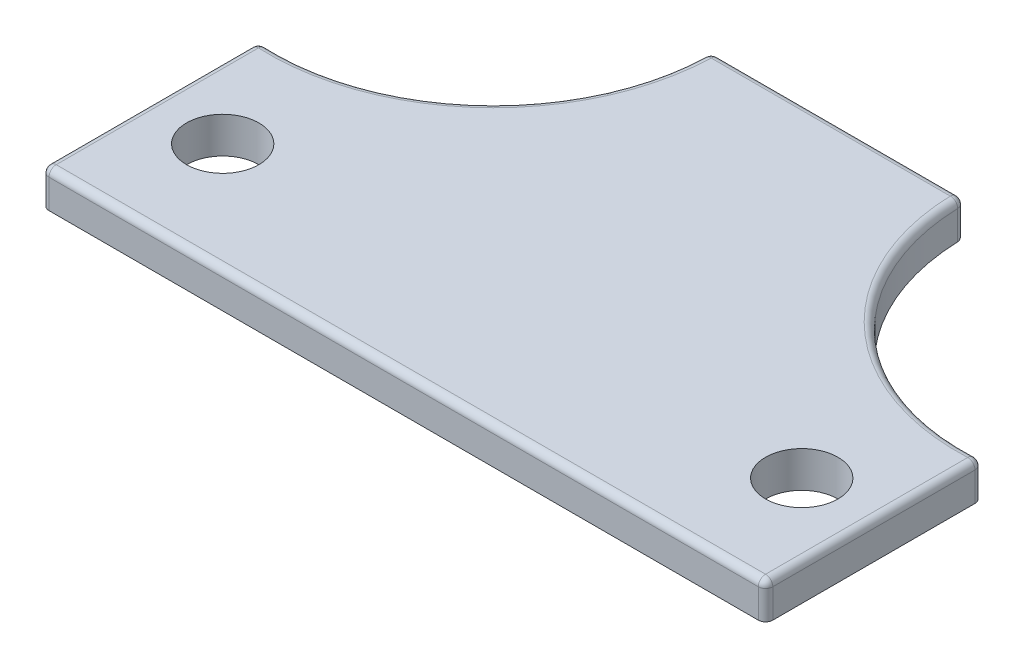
ISO-10303-21;
HEADER;
FILE_DESCRIPTION(('STEP AP214'),'2;1');
FILE_NAME('part.step','',(''),(''),'','','');
FILE_SCHEMA(('AUTOMOTIVE_DESIGN { 1 0 10303 214 1 1 1 1 }'));
ENDSEC;
DATA;
#1=APPLICATION_CONTEXT('core data for automotive mechanical design processes');
#2=APPLICATION_PROTOCOL_DEFINITION('international standard','automotive_design',2000,#1);
#3=PRODUCT_CONTEXT('',#1,'mechanical');
#4=PRODUCT('Part','Part','',(#3));
#5=PRODUCT_RELATED_PRODUCT_CATEGORY('part','',(#4));
#6=PRODUCT_DEFINITION_FORMATION('','',#4);
#7=PRODUCT_DEFINITION_CONTEXT('part definition',#1,'design');
#8=PRODUCT_DEFINITION('design','',#6,#7);
#9=PRODUCT_DEFINITION_SHAPE('','',#8);
#10=(LENGTH_UNIT() NAMED_UNIT(*) SI_UNIT(.MILLI.,.METRE.));
#11=(NAMED_UNIT(*) PLANE_ANGLE_UNIT() SI_UNIT($,.RADIAN.));
#12=(NAMED_UNIT(*) SI_UNIT($,.STERADIAN.) SOLID_ANGLE_UNIT());
#13=UNCERTAINTY_MEASURE_WITH_UNIT(LENGTH_MEASURE(1.E-05),#10,'distance_accuracy_value','');
#14=(GEOMETRIC_REPRESENTATION_CONTEXT(3) GLOBAL_UNCERTAINTY_ASSIGNED_CONTEXT((#13)) GLOBAL_UNIT_ASSIGNED_CONTEXT((#10,
#11,#12)) REPRESENTATION_CONTEXT('',''));
#15=CARTESIAN_POINT('',(0.,0.,0.));
#16=DIRECTION('',(0.,0.,1.));
#17=DIRECTION('',(1.,0.,0.));
#18=AXIS2_PLACEMENT_3D('',#15,#16,#17);
#19=CARTESIAN_POINT('',(-4.75961538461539,0.5,-6.));
#20=DIRECTION('',(0.,1.,0.));
#21=DIRECTION('',(0.,0.,1.));
#22=AXIS2_PLACEMENT_3D('',#19,#20,#21);
#23=PLANE('',#22);
#24=CARTESIAN_POINT('',(4.75961538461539,0.5,-6.));
#25=DIRECTION('',(0.,1.,0.));
#26=DIRECTION('',(0.,0.,1.));
#27=AXIS2_PLACEMENT_3D('',#24,#25,#26);
#28=CIRCLE('',#27,3.10961538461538);
#29=CARTESIAN_POINT('',(4.9,0.5,-2.89355508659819));
#30=VERTEX_POINT('',#29);
#31=CARTESIAN_POINT('',(1.65160833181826,0.5,-5.9));
#32=VERTEX_POINT('',#31);
#33=EDGE_CURVE('E389',#30,#32,#28,.F.);
#34=ORIENTED_EDGE('',*,*,#33,.T.);
#35=DIRECTION('',(-1.,0.,0.));
#36=VECTOR('',#35,1.);
#37=CARTESIAN_POINT('',(-1.75,0.5,-5.9));
#38=LINE('',#37,#36);
#39=CARTESIAN_POINT('',(-1.65160833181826,0.5,-5.9));
#40=VERTEX_POINT('',#39);
#41=EDGE_CURVE('E363',#32,#40,#38,.T.);
#42=ORIENTED_EDGE('',*,*,#41,.T.);
#43=CARTESIAN_POINT('',(-4.75961538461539,0.5,-6.));
#44=DIRECTION('',(0.,1.,0.));
#45=DIRECTION('',(0.,0.,1.));
#46=AXIS2_PLACEMENT_3D('',#43,#44,#45);
#47=CIRCLE('',#46,3.10961538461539);
#48=CARTESIAN_POINT('',(-4.9,0.5,-2.89355508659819));
#49=VERTEX_POINT('',#48);
#50=EDGE_CURVE('E191',#40,#49,#47,.F.);
#51=ORIENTED_EDGE('',*,*,#50,.T.);
#52=DIRECTION('',(0.,0.,1.));
#53=VECTOR('',#52,1.);
#54=CARTESIAN_POINT('',(-4.9,0.5,0.));
#55=LINE('',#54,#53);
#56=CARTESIAN_POINT('',(-4.9,0.5,-0.1));
#57=VERTEX_POINT('',#56);
#58=EDGE_CURVE('E394',#49,#57,#55,.T.);
#59=ORIENTED_EDGE('',*,*,#58,.T.);
#60=DIRECTION('',(1.,0.,0.));
#61=VECTOR('',#60,1.);
#62=CARTESIAN_POINT('',(5.,0.5,-0.1));
#63=LINE('',#62,#61);
#64=CARTESIAN_POINT('',(4.9,0.5,-0.1));
#65=VERTEX_POINT('',#64);
#66=EDGE_CURVE('E393',#57,#65,#63,.T.);
#67=ORIENTED_EDGE('',*,*,#66,.T.);
#68=DIRECTION('',(0.,0.,-1.));
#69=VECTOR('',#68,1.);
#70=CARTESIAN_POINT('',(4.9,0.5,-3.));
#71=LINE('',#70,#69);
#72=EDGE_CURVE('E391',#65,#30,#71,.T.);
#73=ORIENTED_EDGE('',*,*,#72,.T.);
#74=EDGE_LOOP('',(#34,#42,#51,#59,#67,#73));
#75=FACE_BOUND('',#74,.T.);
#76=CARTESIAN_POINT('',(-4.,0.5,-1.5));
#77=DIRECTION('',(0.,1.,0.));
#78=DIRECTION('',(0.,0.,1.));
#79=AXIS2_PLACEMENT_3D('',#76,#77,#78);
#80=CIRCLE('',#79,0.5);
#81=CARTESIAN_POINT('',(-4.,0.5,-0.999999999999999));
#82=VERTEX_POINT('',#81);
#83=EDGE_CURVE('E332',#82,#82,#80,.T.);
#84=ORIENTED_EDGE('',*,*,#83,.F.);
#85=EDGE_LOOP('',(#84));
#86=FACE_BOUND('',#85,.T.);
#87=CARTESIAN_POINT('',(4.,0.5,-1.5));
#88=DIRECTION('',(0.,1.,0.));
#89=DIRECTION('',(0.,0.,1.));
#90=AXIS2_PLACEMENT_3D('',#87,#88,#89);
#91=CIRCLE('',#90,0.5);
#92=CARTESIAN_POINT('',(4.,0.5,-1.));
#93=VERTEX_POINT('',#92);
#94=EDGE_CURVE('E324',#93,#93,#91,.T.);
#95=ORIENTED_EDGE('',*,*,#94,.F.);
#96=EDGE_LOOP('',(#95));
#97=FACE_BOUND('',#96,.T.);
#98=ADVANCED_FACE('F35',(#75,#86,#97),#23,.T.);
#99=CARTESIAN_POINT('',(-4.75961538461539,0.,-6.));
#100=DIRECTION('',(0.,1.,0.));
#101=DIRECTION('',(0.,0.,1.));
#102=AXIS2_PLACEMENT_3D('',#99,#100,#101);
#103=PLANE('',#102);
#104=CARTESIAN_POINT('',(-4.75961538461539,0.,-6.));
#105=DIRECTION('',(0.,-1.,0.));
#106=DIRECTION('',(0.,0.,1.));
#107=AXIS2_PLACEMENT_3D('',#104,#105,#106);
#108=CIRCLE('',#107,3.00961538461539);
#109=CARTESIAN_POINT('',(-1.75166180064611,0.,-5.9));
#110=VERTEX_POINT('',#109);
#111=CARTESIAN_POINT('',(-4.89548546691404,0.,-2.99345312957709));
#112=VERTEX_POINT('',#111);
#113=EDGE_CURVE('E169',#110,#112,#108,.T.);
#114=ORIENTED_EDGE('',*,*,#113,.F.);
#115=DIRECTION('',(-1.,0.,0.));
#116=VECTOR('',#115,1.);
#117=CARTESIAN_POINT('',(-4.75961538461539,0.,-5.9));
#118=LINE('',#117,#116);
#119=CARTESIAN_POINT('',(1.75166180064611,0.,-5.9));
#120=VERTEX_POINT('',#119);
#121=EDGE_CURVE('E252',#110,#120,#118,.F.);
#122=ORIENTED_EDGE('',*,*,#121,.T.);
#123=CARTESIAN_POINT('',(4.75961538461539,0.,-6.));
#124=DIRECTION('',(0.,-1.,0.));
#125=DIRECTION('',(0.,0.,-1.));
#126=AXIS2_PLACEMENT_3D('',#123,#124,#125);
#127=CIRCLE('',#126,3.00961538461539);
#128=CARTESIAN_POINT('',(4.89548546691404,0.,-2.99345312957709));
#129=VERTEX_POINT('',#128);
#130=EDGE_CURVE('E345',#129,#120,#127,.T.);
#131=ORIENTED_EDGE('',*,*,#130,.F.);
#132=CARTESIAN_POINT('',(4.9,0.,-2.89355508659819));
#133=DIRECTION('',(0.,1.,0.));
#134=DIRECTION('',(0.,0.,1.));
#135=AXIS2_PLACEMENT_3D('',#132,#133,#134);
#136=CIRCLE('',#135,0.1);
#137=CARTESIAN_POINT('',(5.,0.,-2.89355508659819));
#138=VERTEX_POINT('',#137);
#139=EDGE_CURVE('E250',#129,#138,#136,.F.);
#140=ORIENTED_EDGE('',*,*,#139,.T.);
#141=DIRECTION('',(0.,0.,-1.));
#142=VECTOR('',#141,1.);
#143=CARTESIAN_POINT('',(5.,0.,0.));
#144=LINE('',#143,#142);
#145=CARTESIAN_POINT('',(5.,0.,-0.1));
#146=VERTEX_POINT('',#145);
#147=EDGE_CURVE('E342',#146,#138,#144,.T.);
#148=ORIENTED_EDGE('',*,*,#147,.F.);
#149=CARTESIAN_POINT('',(4.9,0.,-0.1));
#150=DIRECTION('',(0.,1.,0.));
#151=DIRECTION('',(0.,0.,1.));
#152=AXIS2_PLACEMENT_3D('',#149,#150,#151);
#153=CIRCLE('',#152,0.1);
#154=CARTESIAN_POINT('',(4.9,0.,0.));
#155=VERTEX_POINT('',#154);
#156=EDGE_CURVE('E248',#146,#155,#153,.F.);
#157=ORIENTED_EDGE('',*,*,#156,.T.);
#158=DIRECTION('',(1.,0.,0.));
#159=VECTOR('',#158,1.);
#160=CARTESIAN_POINT('',(5.,0.,0.));
#161=LINE('',#160,#159);
#162=CARTESIAN_POINT('',(-4.9,0.,0.));
#163=VERTEX_POINT('',#162);
#164=EDGE_CURVE('E339',#163,#155,#161,.T.);
#165=ORIENTED_EDGE('',*,*,#164,.F.);
#166=CARTESIAN_POINT('',(-4.9,0.,-0.1));
#167=DIRECTION('',(0.,1.,0.));
#168=DIRECTION('',(0.,0.,1.));
#169=AXIS2_PLACEMENT_3D('',#166,#167,#168);
#170=CIRCLE('',#169,0.1);
#171=CARTESIAN_POINT('',(-5.,0.,-0.1));
#172=VERTEX_POINT('',#171);
#173=EDGE_CURVE('E246',#163,#172,#170,.F.);
#174=ORIENTED_EDGE('',*,*,#173,.T.);
#175=DIRECTION('',(0.,0.,1.));
#176=VECTOR('',#175,1.);
#177=CARTESIAN_POINT('',(-5.,0.,0.));
#178=LINE('',#177,#176);
#179=CARTESIAN_POINT('',(-5.,0.,-2.89355508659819));
#180=VERTEX_POINT('',#179);
#181=EDGE_CURVE('E335',#180,#172,#178,.T.);
#182=ORIENTED_EDGE('',*,*,#181,.F.);
#183=CARTESIAN_POINT('',(-4.9,0.,-2.89355508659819));
#184=DIRECTION('',(0.,1.,0.));
#185=DIRECTION('',(0.,0.,1.));
#186=AXIS2_PLACEMENT_3D('',#183,#184,#185);
#187=CIRCLE('',#186,0.1);
#188=EDGE_CURVE('E242',#180,#112,#187,.F.);
#189=ORIENTED_EDGE('',*,*,#188,.T.);
#190=EDGE_LOOP('',(#114,#122,#131,#140,#148,#157,#165,#174,#182,#189));
#191=FACE_BOUND('',#190,.T.);
#192=CARTESIAN_POINT('',(-4.,0.,-1.5));
#193=DIRECTION('',(0.,1.,0.));
#194=DIRECTION('',(0.,0.,1.));
#195=AXIS2_PLACEMENT_3D('',#192,#193,#194);
#196=CIRCLE('',#195,0.5);
#197=CARTESIAN_POINT('',(-4.,0.,-0.999999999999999));
#198=VERTEX_POINT('',#197);
#199=EDGE_CURVE('E329',#198,#198,#196,.T.);
#200=ORIENTED_EDGE('',*,*,#199,.T.);
#201=EDGE_LOOP('',(#200));
#202=FACE_BOUND('',#201,.T.);
#203=CARTESIAN_POINT('',(4.,0.,-1.5));
#204=DIRECTION('',(0.,1.,0.));
#205=DIRECTION('',(0.,0.,1.));
#206=AXIS2_PLACEMENT_3D('',#203,#204,#205);
#207=CIRCLE('',#206,0.5);
#208=CARTESIAN_POINT('',(4.,0.,-1.));
#209=VERTEX_POINT('',#208);
#210=EDGE_CURVE('E320',#209,#209,#207,.T.);
#211=ORIENTED_EDGE('',*,*,#210,.T.);
#212=EDGE_LOOP('',(#211));
#213=FACE_BOUND('',#212,.T.);
#214=ADVANCED_FACE('F213',(#191,#202,#213),#103,.F.);
#215=CARTESIAN_POINT('',(-5.,0.5,0.));
#216=DIRECTION('',(1.,0.,0.));
#217=DIRECTION('',(0.,0.,-1.));
#218=AXIS2_PLACEMENT_3D('',#215,#216,#217);
#219=PLANE('',#218);
#220=ORIENTED_EDGE('',*,*,#181,.T.);
#221=DIRECTION('',(0.,-1.,0.));
#222=VECTOR('',#221,1.);
#223=CARTESIAN_POINT('',(-5.,0.5,-0.1));
#224=LINE('',#223,#222);
#225=CARTESIAN_POINT('',(-5.,0.4,-0.1));
#226=VERTEX_POINT('',#225);
#227=EDGE_CURVE('E11',#172,#226,#224,.F.);
#228=ORIENTED_EDGE('',*,*,#227,.T.);
#229=DIRECTION('',(0.,0.,1.));
#230=VECTOR('',#229,1.);
#231=CARTESIAN_POINT('',(-5.,0.4,-3.));
#232=LINE('',#231,#230);
#233=CARTESIAN_POINT('',(-5.,0.4,-2.89355508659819));
#234=VERTEX_POINT('',#233);
#235=EDGE_CURVE('E51',#226,#234,#232,.F.);
#236=ORIENTED_EDGE('',*,*,#235,.T.);
#237=DIRECTION('',(0.,-1.,0.));
#238=VECTOR('',#237,1.);
#239=CARTESIAN_POINT('',(-5.,0.5,-2.89355508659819));
#240=LINE('',#239,#238);
#241=EDGE_CURVE('E44',#234,#180,#240,.T.);
#242=ORIENTED_EDGE('',*,*,#241,.T.);
#243=EDGE_LOOP('',(#220,#228,#236,#242));
#244=FACE_BOUND('',#243,.T.);
#245=ADVANCED_FACE('F210',(#244),#219,.F.);
#246=CARTESIAN_POINT('',(5.,0.5,0.));
#247=DIRECTION('',(0.,0.,-1.));
#248=DIRECTION('',(-1.,0.,0.));
#249=AXIS2_PLACEMENT_3D('',#246,#247,#248);
#250=PLANE('',#249);
#251=ORIENTED_EDGE('',*,*,#164,.T.);
#252=DIRECTION('',(0.,-1.,0.));
#253=VECTOR('',#252,1.);
#254=CARTESIAN_POINT('',(4.9,0.5,0.));
#255=LINE('',#254,#253);
#256=CARTESIAN_POINT('',(4.9,0.4,0.));
#257=VERTEX_POINT('',#256);
#258=EDGE_CURVE('E264',#155,#257,#255,.F.);
#259=ORIENTED_EDGE('',*,*,#258,.T.);
#260=DIRECTION('',(1.,0.,0.));
#261=VECTOR('',#260,1.);
#262=CARTESIAN_POINT('',(-5.,0.4,0.));
#263=LINE('',#262,#261);
#264=CARTESIAN_POINT('',(-4.9,0.4,0.));
#265=VERTEX_POINT('',#264);
#266=EDGE_CURVE('E260',#257,#265,#263,.F.);
#267=ORIENTED_EDGE('',*,*,#266,.T.);
#268=DIRECTION('',(0.,-1.,0.));
#269=VECTOR('',#268,1.);
#270=CARTESIAN_POINT('',(-4.9,0.5,0.));
#271=LINE('',#270,#269);
#272=EDGE_CURVE('E262',#265,#163,#271,.T.);
#273=ORIENTED_EDGE('',*,*,#272,.T.);
#274=EDGE_LOOP('',(#251,#259,#267,#273));
#275=FACE_BOUND('',#274,.T.);
#276=ADVANCED_FACE('F206',(#275),#250,.F.);
#277=CARTESIAN_POINT('',(5.,0.5,0.));
#278=DIRECTION('',(-1.,0.,0.));
#279=DIRECTION('',(0.,0.,1.));
#280=AXIS2_PLACEMENT_3D('',#277,#278,#279);
#281=PLANE('',#280);
#282=ORIENTED_EDGE('',*,*,#147,.T.);
#283=DIRECTION('',(0.,-1.,0.));
#284=VECTOR('',#283,1.);
#285=CARTESIAN_POINT('',(5.,0.5,-2.89355508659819));
#286=LINE('',#285,#284);
#287=CARTESIAN_POINT('',(5.,0.4,-2.89355508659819));
#288=VERTEX_POINT('',#287);
#289=EDGE_CURVE('E258',#138,#288,#286,.F.);
#290=ORIENTED_EDGE('',*,*,#289,.T.);
#291=DIRECTION('',(0.,0.,-1.));
#292=VECTOR('',#291,1.);
#293=CARTESIAN_POINT('',(5.,0.4,0.));
#294=LINE('',#293,#292);
#295=CARTESIAN_POINT('',(5.,0.4,-0.1));
#296=VERTEX_POINT('',#295);
#297=EDGE_CURVE('E254',#288,#296,#294,.F.);
#298=ORIENTED_EDGE('',*,*,#297,.T.);
#299=DIRECTION('',(0.,-1.,0.));
#300=VECTOR('',#299,1.);
#301=CARTESIAN_POINT('',(5.,0.5,-0.1));
#302=LINE('',#301,#300);
#303=EDGE_CURVE('E256',#296,#146,#302,.T.);
#304=ORIENTED_EDGE('',*,*,#303,.T.);
#305=EDGE_LOOP('',(#282,#290,#298,#304));
#306=FACE_BOUND('',#305,.T.);
#307=ADVANCED_FACE('F201',(#306),#281,.F.);
#308=CARTESIAN_POINT('',(4.75961538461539,0.5,-6.));
#309=DIRECTION('',(0.,-1.,0.));
#310=DIRECTION('',(0.,0.,-1.));
#311=AXIS2_PLACEMENT_3D('',#308,#309,#310);
#312=CYLINDRICAL_SURFACE('',#311,3.00961538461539);
#313=ORIENTED_EDGE('',*,*,#130,.T.);
#314=CARTESIAN_POINT('',(1.75166180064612,0.,-5.9));
#315=CARTESIAN_POINT('',(1.75164397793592,4.0431391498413E-10,-5.90053610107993));
#316=CARTESIAN_POINT('',(1.75162630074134,4.31071029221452E-06,-5.90107213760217));
#317=CARTESIAN_POINT('',(1.75159123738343,2.15511255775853E-05,-5.90214408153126));
#318=CARTESIAN_POINT('',(1.7515738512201,3.44812348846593E-05,-5.9026799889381));
#319=CARTESIAN_POINT('',(1.7515566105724,5.17212458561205E-05,-5.90321583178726));
#320=B_SPLINE_CURVE_WITH_KNOTS('',3,(#314,#315,#316,#317,#318,#319),.UNSPECIFIED.,.F.,.F.,(4,2,
4),(0.,0.00160903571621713,0.00321807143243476),.UNSPECIFIED.);
#321=CARTESIAN_POINT('',(1.7515566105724,5.17212458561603E-05,-5.90321583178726));
#322=VERTEX_POINT('',#321);
#323=EDGE_CURVE('E184',#120,#322,#320,.T.);
#324=ORIENTED_EDGE('',*,*,#323,.T.);
#325=DIRECTION('',(0.,-1.,0.));
#326=VECTOR('',#325,1.);
#327=CARTESIAN_POINT('',(1.7515566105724,0.5,-5.90321583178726));
#328=LINE('',#327,#326);
#329=CARTESIAN_POINT('',(1.7515566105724,0.4,-5.90321583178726));
#330=VERTEX_POINT('',#329);
#331=EDGE_CURVE('E155',#322,#330,#328,.F.);
#332=ORIENTED_EDGE('',*,*,#331,.T.);
#333=CARTESIAN_POINT('',(4.75961538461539,0.4,-6.));
#334=DIRECTION('',(0.,1.,0.));
#335=DIRECTION('',(0.,0.,1.));
#336=AXIS2_PLACEMENT_3D('',#333,#334,#335);
#337=CIRCLE('',#336,3.00961538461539);
#338=CARTESIAN_POINT('',(4.89548546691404,0.4,-2.99345312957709));
#339=VERTEX_POINT('',#338);
#340=EDGE_CURVE('E175',#330,#339,#337,.T.);
#341=ORIENTED_EDGE('',*,*,#340,.T.);
#342=DIRECTION('',(0.,-1.,0.));
#343=VECTOR('',#342,1.);
#344=CARTESIAN_POINT('',(4.89548546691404,0.5,-2.99345312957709));
#345=LINE('',#344,#343);
#346=EDGE_CURVE('E177',#339,#129,#345,.T.);
#347=ORIENTED_EDGE('',*,*,#346,.T.);
#348=EDGE_LOOP('',(#313,#324,#332,#341,#347));
#349=FACE_BOUND('',#348,.T.);
#350=ADVANCED_FACE('F196',(#349),#312,.F.);
#351=CARTESIAN_POINT('',(-1.75,0.5,-6.));
#352=DIRECTION('',(0.,0.,1.));
#353=DIRECTION('',(1.,0.,0.));
#354=AXIS2_PLACEMENT_3D('',#351,#352,#353);
#355=PLANE('',#354);
#356=DIRECTION('',(-1.,0.,0.));
#357=VECTOR('',#356,1.);
#358=CARTESIAN_POINT('',(1.75,0.4,-6.));
#359=LINE('',#358,#357);
#360=CARTESIAN_POINT('',(-1.65160833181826,0.4,-6.));
#361=VERTEX_POINT('',#360);
#362=CARTESIAN_POINT('',(1.65160833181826,0.4,-6.));
#363=VERTEX_POINT('',#362);
#364=EDGE_CURVE('E173',#361,#363,#359,.F.);
#365=ORIENTED_EDGE('',*,*,#364,.T.);
#366=DIRECTION('',(0.,-1.,0.));
#367=VECTOR('',#366,1.);
#368=CARTESIAN_POINT('',(1.65160833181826,0.5,-6.));
#369=LINE('',#368,#367);
#370=CARTESIAN_POINT('',(1.65160833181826,0.1,-6.));
#371=VERTEX_POINT('',#370);
#372=EDGE_CURVE('E153',#363,#371,#369,.T.);
#373=ORIENTED_EDGE('',*,*,#372,.T.);
#374=DIRECTION('',(-1.,0.,0.));
#375=VECTOR('',#374,1.);
#376=CARTESIAN_POINT('',(-1.75,0.1,-6.));
#377=LINE('',#376,#375);
#378=CARTESIAN_POINT('',(-1.65160833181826,0.1,-6.));
#379=VERTEX_POINT('',#378);
#380=EDGE_CURVE('E161',#371,#379,#377,.T.);
#381=ORIENTED_EDGE('',*,*,#380,.T.);
#382=DIRECTION('',(0.,-1.,0.));
#383=VECTOR('',#382,1.);
#384=CARTESIAN_POINT('',(-1.65160833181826,0.5,-6.));
#385=LINE('',#384,#383);
#386=EDGE_CURVE('E168',#379,#361,#385,.F.);
#387=ORIENTED_EDGE('',*,*,#386,.T.);
#388=EDGE_LOOP('',(#365,#373,#381,#387));
#389=FACE_BOUND('',#388,.T.);
#390=ADVANCED_FACE('F171',(#389),#355,.F.);
#391=CARTESIAN_POINT('',(-4.75961538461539,0.5,-6.));
#392=DIRECTION('',(0.,-1.,0.));
#393=DIRECTION('',(0.,0.,-1.));
#394=AXIS2_PLACEMENT_3D('',#391,#392,#393);
#395=CYLINDRICAL_SURFACE('',#394,3.00961538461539);
#396=DIRECTION('',(0.,-1.,0.));
#397=VECTOR('',#396,1.);
#398=CARTESIAN_POINT('',(-1.7515566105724,0.5,-5.90321583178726));
#399=LINE('',#398,#397);
#400=CARTESIAN_POINT('',(-1.7515566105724,0.4,-5.90321583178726));
#401=VERTEX_POINT('',#400);
#402=CARTESIAN_POINT('',(-1.7515566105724,5.17212458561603E-05,-5.90321583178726));
#403=VERTEX_POINT('',#402);
#404=EDGE_CURVE('E243',#401,#403,#399,.T.);
#405=ORIENTED_EDGE('',*,*,#404,.T.);
#406=CARTESIAN_POINT('',(-1.7515566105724,5.17212458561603E-05,-5.90321583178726));
#407=CARTESIAN_POINT('',(-1.7515738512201,3.44812348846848E-05,-5.9026799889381));
#408=CARTESIAN_POINT('',(-1.75159123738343,2.15511255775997E-05,-5.90214408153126));
#409=CARTESIAN_POINT('',(-1.75162630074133,4.31071029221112E-06,-5.90107213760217));
#410=CARTESIAN_POINT('',(-1.75164397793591,4.04313907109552E-10,-5.90053610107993));
#411=CARTESIAN_POINT('',(-1.75166180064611,0.,-5.9));
#412=B_SPLINE_CURVE_WITH_KNOTS('',3,(#406,#407,#408,#409,#410,#411),.UNSPECIFIED.,.F.,.F.,(4,2,
4),(0.,0.00160903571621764,0.00321807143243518),.UNSPECIFIED.);
#413=EDGE_CURVE('E236',#403,#110,#412,.T.);
#414=ORIENTED_EDGE('',*,*,#413,.T.);
#415=ORIENTED_EDGE('',*,*,#113,.T.);
#416=DIRECTION('',(0.,-1.,0.));
#417=VECTOR('',#416,1.);
#418=CARTESIAN_POINT('',(-4.89548546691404,0.5,-2.99345312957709));
#419=LINE('',#418,#417);
#420=CARTESIAN_POINT('',(-4.89548546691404,0.4,-2.99345312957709));
#421=VERTEX_POINT('',#420);
#422=EDGE_CURVE('E380',#112,#421,#419,.F.);
#423=ORIENTED_EDGE('',*,*,#422,.T.);
#424=CARTESIAN_POINT('',(-4.75961538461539,0.4,-6.));
#425=DIRECTION('',(0.,1.,0.));
#426=DIRECTION('',(0.,0.,1.));
#427=AXIS2_PLACEMENT_3D('',#424,#425,#426);
#428=CIRCLE('',#427,3.00961538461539);
#429=EDGE_CURVE('E385',#421,#401,#428,.T.);
#430=ORIENTED_EDGE('',*,*,#429,.T.);
#431=EDGE_LOOP('',(#405,#414,#415,#423,#430));
#432=FACE_BOUND('',#431,.T.);
#433=ADVANCED_FACE('F231',(#432),#395,.F.);
#434=CARTESIAN_POINT('',(-4.,0.5,-1.5));
#435=DIRECTION('',(0.,-1.,0.));
#436=DIRECTION('',(0.,0.,-1.));
#437=AXIS2_PLACEMENT_3D('',#434,#435,#436);
#438=CYLINDRICAL_SURFACE('',#437,0.5);
#439=ORIENTED_EDGE('',*,*,#83,.T.);
#440=EDGE_LOOP('',(#439));
#441=FACE_BOUND('',#440,.T.);
#442=ORIENTED_EDGE('',*,*,#199,.F.);
#443=EDGE_LOOP('',(#442));
#444=FACE_BOUND('',#443,.T.);
#445=ADVANCED_FACE('F229',(#441,#444),#438,.F.);
#446=CARTESIAN_POINT('',(4.,0.5,-1.5));
#447=DIRECTION('',(0.,-1.,0.));
#448=DIRECTION('',(0.,0.,-1.));
#449=AXIS2_PLACEMENT_3D('',#446,#447,#448);
#450=CYLINDRICAL_SURFACE('',#449,0.5);
#451=ORIENTED_EDGE('',*,*,#94,.T.);
#452=EDGE_LOOP('',(#451));
#453=FACE_BOUND('',#452,.T.);
#454=ORIENTED_EDGE('',*,*,#210,.F.);
#455=EDGE_LOOP('',(#454));
#456=FACE_BOUND('',#455,.T.);
#457=ADVANCED_FACE('F443',(#453,#456),#450,.F.);
#458=CARTESIAN_POINT('',(-4.9,0.5,-0.1));
#459=DIRECTION('',(0.,-1.,0.));
#460=DIRECTION('',(0.,0.,-1.));
#461=AXIS2_PLACEMENT_3D('',#458,#459,#460);
#462=CYLINDRICAL_SURFACE('',#461,0.1);
#463=CARTESIAN_POINT('',(-4.9,0.4,-0.1));
#464=DIRECTION('',(0.,1.,0.));
#465=DIRECTION('',(0.,0.,1.));
#466=AXIS2_PLACEMENT_3D('',#463,#464,#465);
#467=CIRCLE('',#466,0.1);
#468=EDGE_CURVE('E39',#226,#265,#467,.T.);
#469=ORIENTED_EDGE('',*,*,#468,.F.);
#470=ORIENTED_EDGE('',*,*,#227,.F.);
#471=ORIENTED_EDGE('',*,*,#173,.F.);
#472=ORIENTED_EDGE('',*,*,#272,.F.);
#473=EDGE_LOOP('',(#469,#470,#471,#472));
#474=FACE_BOUND('',#473,.T.);
#475=ADVANCED_FACE('F37',(#474),#462,.T.);
#476=CARTESIAN_POINT('',(-4.9,0.4,-0.1));
#477=DIRECTION('',(0.,0.,1.));
#478=DIRECTION('',(1.,0.,0.));
#479=AXIS2_PLACEMENT_3D('',#476,#477,#478);
#480=SPHERICAL_SURFACE('',#479,0.1);
#481=CARTESIAN_POINT('',(-4.9,0.4,-0.1));
#482=DIRECTION('',(0.,0.,1.));
#483=DIRECTION('',(1.,0.,0.));
#484=AXIS2_PLACEMENT_3D('',#481,#482,#483);
#485=CIRCLE('',#484,0.1);
#486=EDGE_CURVE('E311',#226,#57,#485,.F.);
#487=ORIENTED_EDGE('',*,*,#486,.F.);
#488=ORIENTED_EDGE('',*,*,#468,.T.);
#489=CARTESIAN_POINT('',(-4.9,0.4,-0.1));
#490=DIRECTION('',(-1.,0.,0.));
#491=DIRECTION('',(0.,-1.,0.));
#492=AXIS2_PLACEMENT_3D('',#489,#490,#491);
#493=CIRCLE('',#492,0.1);
#494=EDGE_CURVE('E313',#57,#265,#493,.F.);
#495=ORIENTED_EDGE('',*,*,#494,.F.);
#496=EDGE_LOOP('',(#487,#488,#495));
#497=FACE_BOUND('',#496,.T.);
#498=ADVANCED_FACE('F437',(#497),#480,.T.);
#499=CARTESIAN_POINT('',(4.9,0.5,-0.1));
#500=DIRECTION('',(0.,-1.,0.));
#501=DIRECTION('',(0.,0.,-1.));
#502=AXIS2_PLACEMENT_3D('',#499,#500,#501);
#503=CYLINDRICAL_SURFACE('',#502,0.1);
#504=ORIENTED_EDGE('',*,*,#156,.F.);
#505=ORIENTED_EDGE('',*,*,#303,.F.);
#506=CARTESIAN_POINT('',(4.9,0.4,-0.1));
#507=DIRECTION('',(0.,1.,0.));
#508=DIRECTION('',(0.,0.,1.));
#509=AXIS2_PLACEMENT_3D('',#506,#507,#508);
#510=CIRCLE('',#509,0.1);
#511=EDGE_CURVE('E308',#257,#296,#510,.T.);
#512=ORIENTED_EDGE('',*,*,#511,.F.);
#513=ORIENTED_EDGE('',*,*,#258,.F.);
#514=EDGE_LOOP('',(#504,#505,#512,#513));
#515=FACE_BOUND('',#514,.T.);
#516=ADVANCED_FACE('F435',(#515),#503,.T.);
#517=CARTESIAN_POINT('',(-4.75961538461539,0.4,-0.1));
#518=DIRECTION('',(-1.,0.,0.));
#519=DIRECTION('',(0.,0.,1.));
#520=AXIS2_PLACEMENT_3D('',#517,#518,#519);
#521=CYLINDRICAL_SURFACE('',#520,0.1);
#522=ORIENTED_EDGE('',*,*,#494,.T.);
#523=ORIENTED_EDGE('',*,*,#266,.F.);
#524=CARTESIAN_POINT('',(4.9,0.4,-0.1));
#525=DIRECTION('',(1.,0.,0.));
#526=DIRECTION('',(0.,0.,-1.));
#527=AXIS2_PLACEMENT_3D('',#524,#525,#526);
#528=CIRCLE('',#527,0.1);
#529=EDGE_CURVE('E305',#65,#257,#528,.T.);
#530=ORIENTED_EDGE('',*,*,#529,.F.);
#531=ORIENTED_EDGE('',*,*,#66,.F.);
#532=EDGE_LOOP('',(#522,#523,#530,#531));
#533=FACE_BOUND('',#532,.T.);
#534=ADVANCED_FACE('F432',(#533),#521,.T.);
#535=CARTESIAN_POINT('',(-4.9,0.4,-6.));
#536=DIRECTION('',(0.,0.,-1.));
#537=DIRECTION('',(-1.,0.,0.));
#538=AXIS2_PLACEMENT_3D('',#535,#536,#537);
#539=CYLINDRICAL_SURFACE('',#538,0.1);
#540=ORIENTED_EDGE('',*,*,#486,.T.);
#541=ORIENTED_EDGE('',*,*,#58,.F.);
#542=CARTESIAN_POINT('',(-4.9,0.4,-2.89355508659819));
#543=DIRECTION('',(0.,0.,-1.));
#544=DIRECTION('',(0.,1.,0.));
#545=AXIS2_PLACEMENT_3D('',#542,#543,#544);
#546=CIRCLE('',#545,0.1);
#547=EDGE_CURVE('E302',#234,#49,#546,.T.);
#548=ORIENTED_EDGE('',*,*,#547,.F.);
#549=ORIENTED_EDGE('',*,*,#235,.F.);
#550=EDGE_LOOP('',(#540,#541,#548,#549));
#551=FACE_BOUND('',#550,.T.);
#552=ADVANCED_FACE('F399',(#551),#539,.T.);
#553=CARTESIAN_POINT('',(-4.9,0.5,-2.89355508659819));
#554=DIRECTION('',(0.,-1.,0.));
#555=DIRECTION('',(0.,0.,-1.));
#556=AXIS2_PLACEMENT_3D('',#553,#554,#555);
#557=CYLINDRICAL_SURFACE('',#556,0.1);
#558=ORIENTED_EDGE('',*,*,#188,.F.);
#559=ORIENTED_EDGE('',*,*,#241,.F.);
#560=CARTESIAN_POINT('',(-4.9,0.4,-2.89355508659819));
#561=DIRECTION('',(0.,1.,0.));
#562=DIRECTION('',(0.,0.,1.));
#563=AXIS2_PLACEMENT_3D('',#560,#561,#562);
#564=CIRCLE('',#563,0.1);
#565=EDGE_CURVE('E299',#421,#234,#564,.T.);
#566=ORIENTED_EDGE('',*,*,#565,.F.);
#567=ORIENTED_EDGE('',*,*,#422,.F.);
#568=EDGE_LOOP('',(#558,#559,#566,#567));
#569=FACE_BOUND('',#568,.T.);
#570=ADVANCED_FACE('F383',(#569),#557,.T.);
#571=CARTESIAN_POINT('',(4.9,0.4,-0.1));
#572=DIRECTION('',(0.,0.,1.));
#573=DIRECTION('',(1.,0.,0.));
#574=AXIS2_PLACEMENT_3D('',#571,#572,#573);
#575=SPHERICAL_SURFACE('',#574,0.1);
#576=ORIENTED_EDGE('',*,*,#529,.T.);
#577=ORIENTED_EDGE('',*,*,#511,.T.);
#578=CARTESIAN_POINT('',(4.9,0.4,-0.1));
#579=DIRECTION('',(0.,0.,1.));
#580=DIRECTION('',(0.,-1.,0.));
#581=AXIS2_PLACEMENT_3D('',#578,#579,#580);
#582=CIRCLE('',#581,0.1);
#583=EDGE_CURVE('E296',#65,#296,#582,.F.);
#584=ORIENTED_EDGE('',*,*,#583,.F.);
#585=EDGE_LOOP('',(#576,#577,#584));
#586=FACE_BOUND('',#585,.T.);
#587=ADVANCED_FACE('F424',(#586),#575,.T.);
#588=CARTESIAN_POINT('',(-4.9,0.4,-2.89355508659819));
#589=DIRECTION('',(0.,0.,1.));
#590=DIRECTION('',(1.,0.,0.));
#591=AXIS2_PLACEMENT_3D('',#588,#589,#590);
#592=SPHERICAL_SURFACE('',#591,0.1);
#593=ORIENTED_EDGE('',*,*,#565,.T.);
#594=ORIENTED_EDGE('',*,*,#547,.T.);
#595=CARTESIAN_POINT('',(-4.9,0.4,-2.89355508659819));
#596=DIRECTION('',(-0.998980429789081,0.,-0.0451453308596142));
#597=DIRECTION('',(-0.0451453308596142,0.,0.998980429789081));
#598=AXIS2_PLACEMENT_3D('',#595,#596,#597);
#599=CIRCLE('',#598,0.1);
#600=EDGE_CURVE('E293',#421,#49,#599,.F.);
#601=ORIENTED_EDGE('',*,*,#600,.F.);
#602=EDGE_LOOP('',(#593,#594,#601));
#603=FACE_BOUND('',#602,.T.);
#604=ADVANCED_FACE('F401',(#603),#592,.T.);
#605=CARTESIAN_POINT('',(4.9,0.5,-2.89355508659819));
#606=DIRECTION('',(0.,-1.,0.));
#607=DIRECTION('',(0.,0.,-1.));
#608=AXIS2_PLACEMENT_3D('',#605,#606,#607);
#609=CYLINDRICAL_SURFACE('',#608,0.1);
#610=ORIENTED_EDGE('',*,*,#139,.F.);
#611=ORIENTED_EDGE('',*,*,#346,.F.);
#612=CARTESIAN_POINT('',(4.9,0.4,-2.89355508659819));
#613=DIRECTION('',(0.,1.,0.));
#614=DIRECTION('',(0.,0.,1.));
#615=AXIS2_PLACEMENT_3D('',#612,#613,#614);
#616=CIRCLE('',#615,0.1);
#617=EDGE_CURVE('E290',#288,#339,#616,.T.);
#618=ORIENTED_EDGE('',*,*,#617,.F.);
#619=ORIENTED_EDGE('',*,*,#289,.F.);
#620=EDGE_LOOP('',(#610,#611,#618,#619));
#621=FACE_BOUND('',#620,.T.);
#622=ADVANCED_FACE('F414',(#621),#609,.T.);
#623=CARTESIAN_POINT('',(4.9,0.4,-5.99999999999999));
#624=DIRECTION('',(0.,0.,1.));
#625=DIRECTION('',(1.,0.,0.));
#626=AXIS2_PLACEMENT_3D('',#623,#624,#625);
#627=CYLINDRICAL_SURFACE('',#626,0.1);
#628=ORIENTED_EDGE('',*,*,#583,.T.);
#629=ORIENTED_EDGE('',*,*,#297,.F.);
#630=CARTESIAN_POINT('',(4.9,0.4,-2.89355508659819));
#631=DIRECTION('',(0.,0.,-1.));
#632=DIRECTION('',(-1.,0.,0.));
#633=AXIS2_PLACEMENT_3D('',#630,#631,#632);
#634=CIRCLE('',#633,0.1);
#635=EDGE_CURVE('E287',#30,#288,#634,.T.);
#636=ORIENTED_EDGE('',*,*,#635,.F.);
#637=ORIENTED_EDGE('',*,*,#72,.F.);
#638=EDGE_LOOP('',(#628,#629,#636,#637));
#639=FACE_BOUND('',#638,.T.);
#640=ADVANCED_FACE('F406',(#639),#627,.T.);
#641=CARTESIAN_POINT('',(-4.75961538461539,0.4,-6.));
#642=DIRECTION('',(0.,1.,0.));
#643=DIRECTION('',(0.,0.,1.));
#644=AXIS2_PLACEMENT_3D('',#641,#642,#643);
#645=TOROIDAL_SURFACE('',#644,3.10961538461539,0.1);
#646=ORIENTED_EDGE('',*,*,#600,.T.);
#647=ORIENTED_EDGE('',*,*,#50,.F.);
#648=CARTESIAN_POINT('',(-1.65160833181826,0.4,-5.9));
#649=DIRECTION('',(0.0321583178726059,0.,-0.999482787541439));
#650=DIRECTION('',(-0.999482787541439,0.,-0.0321583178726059));
#651=AXIS2_PLACEMENT_3D('',#648,#649,#650);
#652=CIRCLE('',#651,0.1);
#653=EDGE_CURVE('E284',#401,#40,#652,.T.);
#654=ORIENTED_EDGE('',*,*,#653,.F.);
#655=ORIENTED_EDGE('',*,*,#429,.F.);
#656=EDGE_LOOP('',(#646,#647,#654,#655));
#657=FACE_BOUND('',#656,.T.);
#658=ADVANCED_FACE('F403',(#657),#645,.T.);
#659=CARTESIAN_POINT('',(4.9,0.4,-2.89355508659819));
#660=DIRECTION('',(0.,0.,1.));
#661=DIRECTION('',(1.,0.,0.));
#662=AXIS2_PLACEMENT_3D('',#659,#660,#661);
#663=SPHERICAL_SURFACE('',#662,0.1);
#664=ORIENTED_EDGE('',*,*,#635,.T.);
#665=ORIENTED_EDGE('',*,*,#617,.T.);
#666=CARTESIAN_POINT('',(4.9,0.4,-2.89355508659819));
#667=DIRECTION('',(0.998980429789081,0.,-0.045145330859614));
#668=DIRECTION('',(-0.045145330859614,0.,-0.998980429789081));
#669=AXIS2_PLACEMENT_3D('',#666,#667,#668);
#670=CIRCLE('',#669,0.1);
#671=EDGE_CURVE('E281',#30,#339,#670,.F.);
#672=ORIENTED_EDGE('',*,*,#671,.F.);
#673=EDGE_LOOP('',(#664,#665,#672));
#674=FACE_BOUND('',#673,.T.);
#675=ADVANCED_FACE('F405',(#674),#663,.T.);
#676=CARTESIAN_POINT('',(-1.65160833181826,0.4,-5.9));
#677=DIRECTION('',(0.,0.,1.));
#678=DIRECTION('',(1.,0.,0.));
#679=AXIS2_PLACEMENT_3D('',#676,#677,#678);
#680=SPHERICAL_SURFACE('',#679,0.1);
#681=CARTESIAN_POINT('',(-1.65160833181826,0.4,-5.9));
#682=DIRECTION('',(0.,1.,0.));
#683=DIRECTION('',(0.,0.,1.));
#684=AXIS2_PLACEMENT_3D('',#681,#682,#683);
#685=CIRCLE('',#684,0.1);
#686=EDGE_CURVE('E276',#401,#361,#685,.F.);
#687=ORIENTED_EDGE('',*,*,#686,.F.);
#688=ORIENTED_EDGE('',*,*,#653,.T.);
#689=CARTESIAN_POINT('',(-1.65160833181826,0.4,-5.9));
#690=DIRECTION('',(-1.,0.,0.));
#691=DIRECTION('',(0.,0.,1.));
#692=AXIS2_PLACEMENT_3D('',#689,#690,#691);
#693=CIRCLE('',#692,0.1);
#694=EDGE_CURVE('E279',#361,#40,#693,.F.);
#695=ORIENTED_EDGE('',*,*,#694,.F.);
#696=EDGE_LOOP('',(#687,#688,#695));
#697=FACE_BOUND('',#696,.T.);
#698=ADVANCED_FACE('F355',(#697),#680,.T.);
#699=CARTESIAN_POINT('',(4.75961538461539,0.4,-6.));
#700=DIRECTION('',(0.,1.,0.));
#701=DIRECTION('',(0.,0.,1.));
#702=AXIS2_PLACEMENT_3D('',#699,#700,#701);
#703=TOROIDAL_SURFACE('',#702,3.10961538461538,0.1);
#704=ORIENTED_EDGE('',*,*,#671,.T.);
#705=ORIENTED_EDGE('',*,*,#340,.F.);
#706=CARTESIAN_POINT('',(1.65160833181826,0.4,-5.9));
#707=DIRECTION('',(-0.0321583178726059,0.,-0.999482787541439));
#708=DIRECTION('',(-0.999482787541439,0.,0.0321583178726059));
#709=AXIS2_PLACEMENT_3D('',#706,#707,#708);
#710=CIRCLE('',#709,0.1);
#711=EDGE_CURVE('E273',#32,#330,#710,.T.);
#712=ORIENTED_EDGE('',*,*,#711,.F.);
#713=ORIENTED_EDGE('',*,*,#33,.F.);
#714=EDGE_LOOP('',(#704,#705,#712,#713));
#715=FACE_BOUND('',#714,.T.);
#716=ADVANCED_FACE('F369',(#715),#703,.T.);
#717=CARTESIAN_POINT('',(-4.75961538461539,0.4,-5.9));
#718=DIRECTION('',(1.,0.,0.));
#719=DIRECTION('',(0.,0.,-1.));
#720=AXIS2_PLACEMENT_3D('',#717,#718,#719);
#721=CYLINDRICAL_SURFACE('',#720,0.1);
#722=ORIENTED_EDGE('',*,*,#694,.T.);
#723=ORIENTED_EDGE('',*,*,#41,.F.);
#724=CARTESIAN_POINT('',(1.65160833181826,0.4,-5.9));
#725=DIRECTION('',(1.,0.,0.));
#726=DIRECTION('',(0.,1.,0.));
#727=AXIS2_PLACEMENT_3D('',#724,#725,#726);
#728=CIRCLE('',#727,0.1);
#729=EDGE_CURVE('E270',#363,#32,#728,.T.);
#730=ORIENTED_EDGE('',*,*,#729,.F.);
#731=ORIENTED_EDGE('',*,*,#364,.F.);
#732=EDGE_LOOP('',(#722,#723,#730,#731));
#733=FACE_BOUND('',#732,.T.);
#734=ADVANCED_FACE('F360',(#733),#721,.T.);
#735=CARTESIAN_POINT('',(-1.65160833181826,0.5,-5.9));
#736=DIRECTION('',(0.,-1.,0.));
#737=DIRECTION('',(0.,0.,-1.));
#738=AXIS2_PLACEMENT_3D('',#735,#736,#737);
#739=CYLINDRICAL_SURFACE('',#738,0.1);
#740=ORIENTED_EDGE('',*,*,#686,.T.);
#741=ORIENTED_EDGE('',*,*,#386,.F.);
#742=CARTESIAN_POINT('',(-1.65160833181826,0.1,-5.9));
#743=DIRECTION('',(-0.707106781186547,0.707106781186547,0.));
#744=DIRECTION('',(-0.707106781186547,-0.707106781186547,0.));
#745=AXIS2_PLACEMENT_3D('',#742,#743,#744);
#746=ELLIPSE('',#745,0.14142135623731,0.1);
#747=EDGE_CURVE('E165',#403,#379,#746,.F.);
#748=ORIENTED_EDGE('',*,*,#747,.F.);
#749=ORIENTED_EDGE('',*,*,#404,.F.);
#750=EDGE_LOOP('',(#740,#741,#748,#749));
#751=FACE_BOUND('',#750,.T.);
#752=ADVANCED_FACE('F353',(#751),#739,.T.);
#753=CARTESIAN_POINT('',(1.65160833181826,0.4,-5.9));
#754=DIRECTION('',(0.,0.,1.));
#755=DIRECTION('',(1.,0.,0.));
#756=AXIS2_PLACEMENT_3D('',#753,#754,#755);
#757=SPHERICAL_SURFACE('',#756,0.1);
#758=ORIENTED_EDGE('',*,*,#729,.T.);
#759=ORIENTED_EDGE('',*,*,#711,.T.);
#760=CARTESIAN_POINT('',(1.65160833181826,0.4,-5.9));
#761=DIRECTION('',(0.,1.,0.));
#762=DIRECTION('',(0.,0.,1.));
#763=AXIS2_PLACEMENT_3D('',#760,#761,#762);
#764=CIRCLE('',#763,0.1);
#765=EDGE_CURVE('E158',#363,#330,#764,.F.);
#766=ORIENTED_EDGE('',*,*,#765,.F.);
#767=EDGE_LOOP('',(#758,#759,#766));
#768=FACE_BOUND('',#767,.T.);
#769=ADVANCED_FACE('F218',(#768),#757,.T.);
#770=CARTESIAN_POINT('',(-1.75,0.1,-5.9));
#771=DIRECTION('',(-1.,0.,0.));
#772=DIRECTION('',(0.,0.,1.));
#773=AXIS2_PLACEMENT_3D('',#770,#771,#772);
#774=CYLINDRICAL_SURFACE('',#773,0.1);
#775=ORIENTED_EDGE('',*,*,#747,.T.);
#776=ORIENTED_EDGE('',*,*,#380,.F.);
#777=CARTESIAN_POINT('',(1.65160833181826,0.1,-5.9));
#778=DIRECTION('',(-0.707106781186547,-0.707106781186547,0.));
#779=DIRECTION('',(-0.707106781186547,0.707106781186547,0.));
#780=AXIS2_PLACEMENT_3D('',#777,#778,#779);
#781=ELLIPSE('',#780,0.14142135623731,0.1);
#782=EDGE_CURVE('E149',#322,#371,#781,.F.);
#783=ORIENTED_EDGE('',*,*,#782,.F.);
#784=ORIENTED_EDGE('',*,*,#323,.F.);
#785=ORIENTED_EDGE('',*,*,#121,.F.);
#786=ORIENTED_EDGE('',*,*,#413,.F.);
#787=EDGE_LOOP('',(#775,#776,#783,#784,#785,#786));
#788=FACE_BOUND('',#787,.T.);
#789=ADVANCED_FACE('F162',(#788),#774,.T.);
#790=CARTESIAN_POINT('',(1.65160833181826,0.5,-5.9));
#791=DIRECTION('',(0.,-1.,0.));
#792=DIRECTION('',(0.,0.,-1.));
#793=AXIS2_PLACEMENT_3D('',#790,#791,#792);
#794=CYLINDRICAL_SURFACE('',#793,0.1);
#795=ORIENTED_EDGE('',*,*,#765,.T.);
#796=ORIENTED_EDGE('',*,*,#331,.F.);
#797=ORIENTED_EDGE('',*,*,#782,.T.);
#798=ORIENTED_EDGE('',*,*,#372,.F.);
#799=EDGE_LOOP('',(#795,#796,#797,#798));
#800=FACE_BOUND('',#799,.T.);
#801=ADVANCED_FACE('F151',(#800),#794,.T.);
#802=CLOSED_SHELL('',(#98,#214,#245,#276,#307,#350,#390,#433,#445,#457,#475,#498,#516,#534,#552,
#570,#587,#604,#622,#640,#658,#675,#698,#716,#734,#752,#769,#789,#801));
#803=MANIFOLD_SOLID_BREP('B2',#802);
#804=ADVANCED_BREP_SHAPE_REPRESENTATION('',(#18,#803),#14);
#805=SHAPE_DEFINITION_REPRESENTATION(#9,#804);
ENDSEC;
END-ISO-10303-21;
